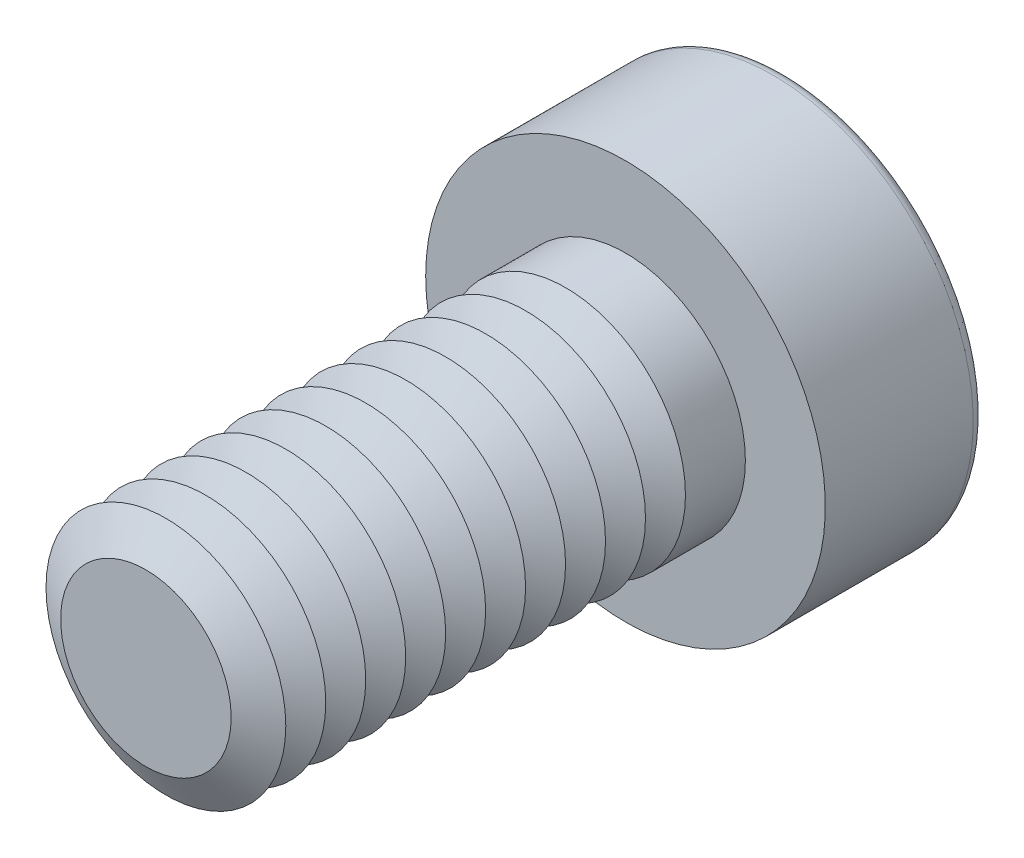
from build123d import *

# Parameters (mm, degrees)
SKETCH1_R           = 3
BOSS_EXTRUDE1_DEPTH = 12
SKETCH2_R           = 5
BOSS_EXTRUDE2_DEPTH = 4
CUT_EXTRUDE1_DEPTH  = 3
FILLET1_R           = 0.3
LPATTERN1_COUNT     = 11
LPATTERN1_PITCH     = 1


with BuildPart() as part:
    # Sketch1 → Boss-Extrude1 (new body)
    with BuildSketch(Plane.XY):
        Circle(SKETCH1_R)
    extrude(amount=BOSS_EXTRUDE1_DEPTH)

    # Sketch2 → Boss-Extrude2 (add)
    with BuildSketch(Plane(origin=(0, 0, 0), x_dir=(-1, 0, 0), z_dir=(0, 0, -1))):
        Circle(SKETCH2_R)
    extrude(amount=BOSS_EXTRUDE2_DEPTH)

    # Sketch3 → Cut-Extrude1 (cut)
    with BuildSketch(Plane(origin=(0, 0, -4), x_dir=(-1, 0, 0), z_dir=(0, 0, -1))):
        Polygon((-1.154700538, 2), (-2.309401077, 0), (-1.154700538, -2), (1.154700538, -2), (2.309401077, 0), (1.154700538, 2), align=None)
    extrude(amount=-CUT_EXTRUDE1_DEPTH, mode=Mode.SUBTRACT)

    # Fillet1
    fillet1_edges = [part.edges().sort_by_distance(p)[0] for p in [
        (5, 0, -4),
    ]]
    fillet(fillet1_edges, radius=FILLET1_R)

    # Cut-Extrude2 cone 1 section (on through the dimple's axis) → Cut-Extrude2 (revolve, cut)
    with BuildSketch(Plane(origin=(0, 0, -1), x_dir=(0, 1, 0), z_dir=(1, 0, 0))):
        Polygon((0, 0), (2, 0), (0, 1.154700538), align=None)
    revolve(axis=Axis((0, 0, -1), (0, 0, 1)), mode=Mode.SUBTRACT)

    # Cut-Extrude3 cone 1 section (on through the dimple's axis) → Cut-Extrude3 (revolve, cut)
    with BuildSketch(Plane(origin=(0, 0, -4), x_dir=(0, 1, 0), z_dir=(1, 0, 0))):
        Polygon((0, 0), (2.309401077, 0), (0, 0.618802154), align=None)
    revolve(axis=Axis((0, 0, -4), (0, 0, 1)), mode=Mode.SUBTRACT)

    # Sketch7 → Cut-Revolve1 (revolve, cut)
    with BuildSketch(Plane(origin=(0, 0, 0), x_dir=(0, 0, -1), z_dir=(1, 0, 0)), mode=Mode.PRIVATE) as cut_revolve1_sk:
        Polygon((-12, 2.133974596), (-11.5, 3), (-12.5, 3), align=None)
    cut_revolve1 = revolve(cut_revolve1_sk.sketch.rotate(Axis((0, 0, 12), (0, 0, -1)), 90), axis=Axis((0, 0, 12), (0, 0, -1)), mode=Mode.SUBTRACT)

    # LPattern1: Cut-Revolve1 ×11
    with Locations(*[(0, 0, -i * LPATTERN1_PITCH) for i in range(1, LPATTERN1_COUNT)]):
        add(cut_revolve1, mode=Mode.SUBTRACT)


solid = part.part
